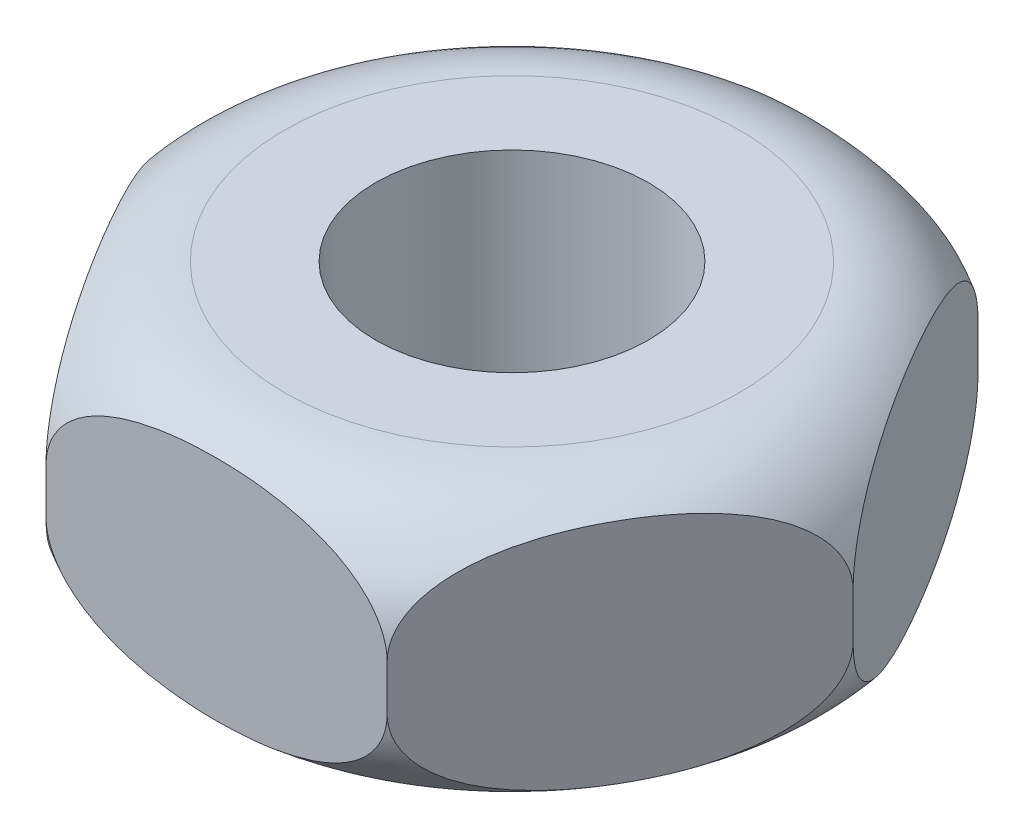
from build123d import *

# Parameters (mm, degrees)
SKETCH1_R      = 6
EXTRUDE1_DEPTH = 12


with BuildPart() as part:
    # Sketch1 → Extrude1 (new body)
    with BuildSketch(Plane(origin=(0, 0, 0), x_dir=(1, 0, 0), z_dir=(0, 1, 0))):
        Polygon((15, 0), (7.5, 12.990381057), (-7.5, 12.990381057), (-15, 0), (-7.5, -12.990381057), (7.5, -12.990381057), align=None)
        with Locations(Location((0, 0, 0), (0, 0, 270))):
            Circle(SKETCH1_R, mode=Mode.SUBTRACT)
    extrude(amount=EXTRUDE1_DEPTH)

    # Sketch2 → Cut-Revolve1 (revolve, cut)
    with BuildSketch(Plane.XY, mode=Mode.PRIVATE) as cut_revolve1_sk:
        with BuildLine():
            Line((10, 12), (10, 17.002406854))
            Line((10, 17.002406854), (18.004286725, 17.002406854))
            Line((18.004286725, 17.002406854), (18.004286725, 7))
            Line((18.004286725, 7), (15, 7))
            ThreePointArc((15, 7), (13.535533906, 10.535533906), (10, 12))
        make_face()
        with BuildLine():
            Line((18.004286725, 5), (15, 5))
            ThreePointArc((15, 5), (13.535533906, 1.464466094), (10, 0))
            Line((10, 0), (10, -5.002406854))
            Line((10, -5.002406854), (18.004286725, -5.002406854))
            Line((18.004286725, -5.002406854), (18.004286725, 5))
        make_face()
    revolve(cut_revolve1_sk.sketch.rotate(Axis((0, 15.241204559, 0), (0, -1, 0)), 90), axis=Axis((0, 15.241204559, 0), (0, -1, 0)), mode=Mode.SUBTRACT)


solid = part.part
